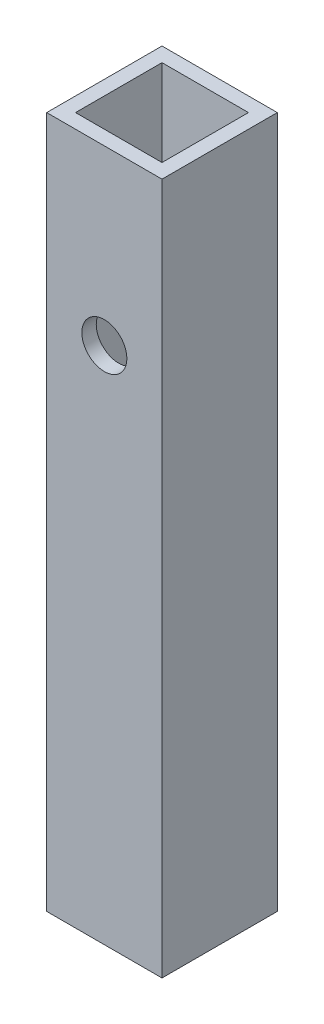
from build123d import *

# Parameters (mm, degrees)
SKETCH1_W          = 50.8
SKETCH1_H          = 50.8
SKETCH1_W_2        = 38.1
SKETCH1_H_2        = 38.1
EXTRUDE1_DEPTH     = 304.8
SKETCH2_R          = 9.9187
CUT_EXTRUDE1_DEPTH = 311.04651264


with BuildPart() as part:
    # Sketch1 → Extrude1 (new body)
    with BuildSketch(Plane(origin=(0, 0, 0), x_dir=(1, 0, 0), z_dir=(0, 1, 0))):
        Rectangle(SKETCH1_W, SKETCH1_H)
        Rectangle(SKETCH1_W_2, SKETCH1_H_2, mode=Mode.SUBTRACT)
    extrude(amount=-EXTRUDE1_DEPTH)

    # Sketch2 → Cut-Extrude1 (cut, through all)
    with BuildSketch(Plane(origin=(0, 0, -25.4), x_dir=(-1, 0, 0), z_dir=(0, 0, -1))):
        with Locations((0, -76.2)):
            Circle(SKETCH2_R)
    extrude(amount=-CUT_EXTRUDE1_DEPTH, mode=Mode.SUBTRACT)


solid = part.part
